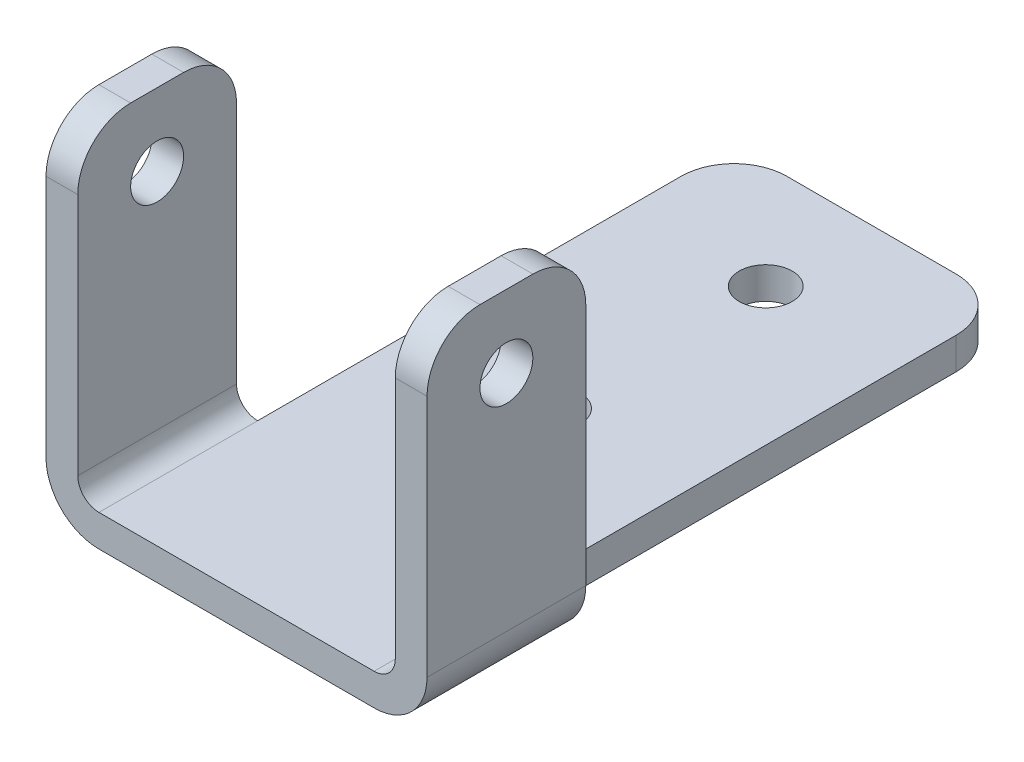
ISO-10303-21;
HEADER;
FILE_DESCRIPTION(('STEP AP214'),'2;1');
FILE_NAME('part.step','',(''),(''),'','','');
FILE_SCHEMA(('AUTOMOTIVE_DESIGN { 1 0 10303 214 1 1 1 1 }'));
ENDSEC;
DATA;
#1=APPLICATION_CONTEXT('core data for automotive mechanical design processes');
#2=APPLICATION_PROTOCOL_DEFINITION('international standard','automotive_design',2000,#1);
#3=PRODUCT_CONTEXT('',#1,'mechanical');
#4=PRODUCT('Part','Part','',(#3));
#5=PRODUCT_RELATED_PRODUCT_CATEGORY('part','',(#4));
#6=PRODUCT_DEFINITION_FORMATION('','',#4);
#7=PRODUCT_DEFINITION_CONTEXT('part definition',#1,'design');
#8=PRODUCT_DEFINITION('design','',#6,#7);
#9=PRODUCT_DEFINITION_SHAPE('','',#8);
#10=(LENGTH_UNIT() NAMED_UNIT(*) SI_UNIT(.MILLI.,.METRE.));
#11=(NAMED_UNIT(*) PLANE_ANGLE_UNIT() SI_UNIT($,.RADIAN.));
#12=(NAMED_UNIT(*) SI_UNIT($,.STERADIAN.) SOLID_ANGLE_UNIT());
#13=UNCERTAINTY_MEASURE_WITH_UNIT(LENGTH_MEASURE(1.E-05),#10,'distance_accuracy_value','');
#14=(GEOMETRIC_REPRESENTATION_CONTEXT(3) GLOBAL_UNCERTAINTY_ASSIGNED_CONTEXT((#13)) GLOBAL_UNIT_ASSIGNED_CONTEXT((#10,
#11,#12)) REPRESENTATION_CONTEXT('',''));
#15=CARTESIAN_POINT('',(0.,0.,0.));
#16=DIRECTION('',(0.,0.,1.));
#17=DIRECTION('',(1.,0.,0.));
#18=AXIS2_PLACEMENT_3D('',#15,#16,#17);
#19=CARTESIAN_POINT('',(-18.,30.,15.));
#20=DIRECTION('',(1.,0.,0.));
#21=DIRECTION('',(0.,0.,-1.));
#22=AXIS2_PLACEMENT_3D('',#19,#20,#21);
#23=PLANE('',#22);
#24=CARTESIAN_POINT('',(-18.,23.15,7.5));
#25=DIRECTION('',(1.,0.,0.));
#26=DIRECTION('',(0.,0.,-1.));
#27=AXIS2_PLACEMENT_3D('',#24,#25,#26);
#28=CIRCLE('',#27,2.5);
#29=CARTESIAN_POINT('',(-18.,23.15,5.));
#30=VERTEX_POINT('',#29);
#31=EDGE_CURVE('E265',#30,#30,#28,.T.);
#32=ORIENTED_EDGE('',*,*,#31,.T.);
#33=EDGE_LOOP('',(#32));
#34=FACE_BOUND('',#33,.T.);
#35=CARTESIAN_POINT('',(-18.,25.,10.));
#36=DIRECTION('',(-1.,0.,0.));
#37=DIRECTION('',(0.,0.,1.));
#38=AXIS2_PLACEMENT_3D('',#35,#36,#37);
#39=CIRCLE('',#38,5.);
#40=CARTESIAN_POINT('',(-18.,30.,10.));
#41=VERTEX_POINT('',#40);
#42=CARTESIAN_POINT('',(-18.,25.,15.));
#43=VERTEX_POINT('',#42);
#44=EDGE_CURVE('E20',#41,#43,#39,.F.);
#45=ORIENTED_EDGE('',*,*,#44,.F.);
#46=DIRECTION('',(0.,0.,1.));
#47=VECTOR('',#46,1.);
#48=CARTESIAN_POINT('',(-18.,30.,15.));
#49=LINE('',#48,#47);
#50=CARTESIAN_POINT('',(-18.,30.,5.));
#51=VERTEX_POINT('',#50);
#52=EDGE_CURVE('E153',#51,#41,#49,.T.);
#53=ORIENTED_EDGE('',*,*,#52,.F.);
#54=CARTESIAN_POINT('',(-18.,25.,5.));
#55=DIRECTION('',(1.,0.,0.));
#56=DIRECTION('',(0.,0.,-1.));
#57=AXIS2_PLACEMENT_3D('',#54,#55,#56);
#58=CIRCLE('',#57,5.);
#59=CARTESIAN_POINT('',(-18.,25.,0.));
#60=VERTEX_POINT('',#59);
#61=EDGE_CURVE('E172',#60,#51,#58,.T.);
#62=ORIENTED_EDGE('',*,*,#61,.F.);
#63=DIRECTION('',(0.,1.,0.));
#64=VECTOR('',#63,1.);
#65=CARTESIAN_POINT('',(-18.,-3.,0.));
#66=LINE('',#65,#64);
#67=CARTESIAN_POINT('',(-18.,2.,0.));
#68=VERTEX_POINT('',#67);
#69=EDGE_CURVE('E267',#68,#60,#66,.T.);
#70=ORIENTED_EDGE('',*,*,#69,.F.);
#71=DIRECTION('',(0.,0.,-1.));
#72=VECTOR('',#71,1.);
#73=CARTESIAN_POINT('',(-18.,2.,15.));
#74=LINE('',#73,#72);
#75=CARTESIAN_POINT('',(-18.,2.,15.));
#76=VERTEX_POINT('',#75);
#77=EDGE_CURVE('E280',#76,#68,#74,.T.);
#78=ORIENTED_EDGE('',*,*,#77,.F.);
#79=DIRECTION('',(0.,1.,0.));
#80=VECTOR('',#79,1.);
#81=CARTESIAN_POINT('',(-18.,2.,15.));
#82=LINE('',#81,#80);
#83=EDGE_CURVE('E156',#76,#43,#82,.T.);
#84=ORIENTED_EDGE('',*,*,#83,.T.);
#85=EDGE_LOOP('',(#45,#53,#62,#70,#78,#84));
#86=FACE_BOUND('',#85,.T.);
#87=ADVANCED_FACE('F17',(#34,#86),#23,.F.);
#88=CARTESIAN_POINT('',(18.,0.,15.));
#89=DIRECTION('',(-1.,0.,0.));
#90=DIRECTION('',(0.,-1.,0.));
#91=AXIS2_PLACEMENT_3D('',#88,#89,#90);
#92=PLANE('',#91);
#93=CARTESIAN_POINT('',(18.,23.15,7.5));
#94=DIRECTION('',(1.,0.,0.));
#95=DIRECTION('',(0.,0.,-1.));
#96=AXIS2_PLACEMENT_3D('',#93,#94,#95);
#97=CIRCLE('',#96,2.5);
#98=CARTESIAN_POINT('',(18.,23.15,5.));
#99=VERTEX_POINT('',#98);
#100=EDGE_CURVE('E257',#99,#99,#97,.F.);
#101=ORIENTED_EDGE('',*,*,#100,.T.);
#102=EDGE_LOOP('',(#101));
#103=FACE_BOUND('',#102,.T.);
#104=CARTESIAN_POINT('',(18.,25.,10.));
#105=DIRECTION('',(1.,0.,0.));
#106=DIRECTION('',(0.,0.,-1.));
#107=AXIS2_PLACEMENT_3D('',#104,#105,#106);
#108=CIRCLE('',#107,5.);
#109=CARTESIAN_POINT('',(18.,25.,15.));
#110=VERTEX_POINT('',#109);
#111=CARTESIAN_POINT('',(18.,30.,10.));
#112=VERTEX_POINT('',#111);
#113=EDGE_CURVE('E263',#110,#112,#108,.F.);
#114=ORIENTED_EDGE('',*,*,#113,.F.);
#115=DIRECTION('',(0.,1.,0.));
#116=VECTOR('',#115,1.);
#117=CARTESIAN_POINT('',(18.,-3.,15.));
#118=LINE('',#117,#116);
#119=CARTESIAN_POINT('',(18.,2.,15.));
#120=VERTEX_POINT('',#119);
#121=EDGE_CURVE('E260',#120,#110,#118,.T.);
#122=ORIENTED_EDGE('',*,*,#121,.F.);
#123=DIRECTION('',(0.,0.,-1.));
#124=VECTOR('',#123,1.);
#125=CARTESIAN_POINT('',(18.,2.,15.));
#126=LINE('',#125,#124);
#127=CARTESIAN_POINT('',(18.,2.,0.));
#128=VERTEX_POINT('',#127);
#129=EDGE_CURVE('E283',#128,#120,#126,.F.);
#130=ORIENTED_EDGE('',*,*,#129,.F.);
#131=DIRECTION('',(0.,1.,0.));
#132=VECTOR('',#131,1.);
#133=CARTESIAN_POINT('',(18.,2.,0.));
#134=LINE('',#133,#132);
#135=CARTESIAN_POINT('',(18.,25.,0.));
#136=VERTEX_POINT('',#135);
#137=EDGE_CURVE('E284',#136,#128,#134,.F.);
#138=ORIENTED_EDGE('',*,*,#137,.F.);
#139=CARTESIAN_POINT('',(18.,25.,5.));
#140=DIRECTION('',(1.,0.,0.));
#141=DIRECTION('',(0.,0.,-1.));
#142=AXIS2_PLACEMENT_3D('',#139,#140,#141);
#143=CIRCLE('',#142,5.);
#144=CARTESIAN_POINT('',(18.,30.,5.));
#145=VERTEX_POINT('',#144);
#146=EDGE_CURVE('E261',#145,#136,#143,.F.);
#147=ORIENTED_EDGE('',*,*,#146,.F.);
#148=DIRECTION('',(0.,0.,1.));
#149=VECTOR('',#148,1.);
#150=CARTESIAN_POINT('',(18.,30.,15.));
#151=LINE('',#150,#149);
#152=EDGE_CURVE('E178',#112,#145,#151,.F.);
#153=ORIENTED_EDGE('',*,*,#152,.F.);
#154=EDGE_LOOP('',(#114,#122,#130,#138,#147,#153));
#155=FACE_BOUND('',#154,.T.);
#156=ADVANCED_FACE('F374',(#103,#155),#92,.F.);
#157=CARTESIAN_POINT('',(-18.,30.,15.));
#158=DIRECTION('',(0.,1.,0.));
#159=DIRECTION('',(0.,0.,1.));
#160=AXIS2_PLACEMENT_3D('',#157,#158,#159);
#161=PLANE('',#160);
#162=DIRECTION('',(0.,0.,-1.));
#163=VECTOR('',#162,1.);
#164=CARTESIAN_POINT('',(-15.,30.,15.));
#165=LINE('',#164,#163);
#166=CARTESIAN_POINT('',(-15.,30.,5.));
#167=VERTEX_POINT('',#166);
#168=CARTESIAN_POINT('',(-15.,30.,10.));
#169=VERTEX_POINT('',#168);
#170=EDGE_CURVE('E256',#167,#169,#165,.F.);
#171=ORIENTED_EDGE('',*,*,#170,.F.);
#172=DIRECTION('',(1.,0.,0.));
#173=VECTOR('',#172,1.);
#174=CARTESIAN_POINT('',(-13.,30.,5.));
#175=LINE('',#174,#173);
#176=EDGE_CURVE('E165',#51,#167,#175,.T.);
#177=ORIENTED_EDGE('',*,*,#176,.F.);
#178=ORIENTED_EDGE('',*,*,#52,.T.);
#179=DIRECTION('',(-1.,0.,0.));
#180=VECTOR('',#179,1.);
#181=CARTESIAN_POINT('',(-18.,30.,10.));
#182=LINE('',#181,#180);
#183=EDGE_CURVE('E160',#169,#41,#182,.T.);
#184=ORIENTED_EDGE('',*,*,#183,.F.);
#185=EDGE_LOOP('',(#171,#177,#178,#184));
#186=FACE_BOUND('',#185,.T.);
#187=ADVANCED_FACE('F162',(#186),#161,.T.);
#188=CARTESIAN_POINT('',(-18.,25.,10.));
#189=DIRECTION('',(-1.,0.,0.));
#190=DIRECTION('',(0.,0.,1.));
#191=AXIS2_PLACEMENT_3D('',#188,#189,#190);
#192=CYLINDRICAL_SURFACE('',#191,5.);
#193=CARTESIAN_POINT('',(-15.,25.,10.));
#194=DIRECTION('',(-1.,0.,0.));
#195=DIRECTION('',(0.,0.,1.));
#196=AXIS2_PLACEMENT_3D('',#193,#194,#195);
#197=CIRCLE('',#196,5.);
#198=CARTESIAN_POINT('',(-15.,25.,15.));
#199=VERTEX_POINT('',#198);
#200=EDGE_CURVE('E170',#169,#199,#197,.F.);
#201=ORIENTED_EDGE('',*,*,#200,.F.);
#202=ORIENTED_EDGE('',*,*,#183,.T.);
#203=ORIENTED_EDGE('',*,*,#44,.T.);
#204=DIRECTION('',(-1.,0.,0.));
#205=VECTOR('',#204,1.);
#206=CARTESIAN_POINT('',(13.,25.,15.));
#207=LINE('',#206,#205);
#208=EDGE_CURVE('E176',#43,#199,#207,.F.);
#209=ORIENTED_EDGE('',*,*,#208,.T.);
#210=EDGE_LOOP('',(#201,#202,#203,#209));
#211=FACE_BOUND('',#210,.T.);
#212=ADVANCED_FACE('F168',(#211),#192,.T.);
#213=CARTESIAN_POINT('',(-13.,25.,5.));
#214=DIRECTION('',(1.,0.,0.));
#215=DIRECTION('',(0.,0.,-1.));
#216=AXIS2_PLACEMENT_3D('',#213,#214,#215);
#217=CYLINDRICAL_SURFACE('',#216,5.);
#218=CARTESIAN_POINT('',(-15.,25.,5.));
#219=DIRECTION('',(1.,0.,0.));
#220=DIRECTION('',(0.,0.,-1.));
#221=AXIS2_PLACEMENT_3D('',#218,#219,#220);
#222=CIRCLE('',#221,5.);
#223=CARTESIAN_POINT('',(-15.,25.,0.));
#224=VERTEX_POINT('',#223);
#225=EDGE_CURVE('E250',#224,#167,#222,.T.);
#226=ORIENTED_EDGE('',*,*,#225,.F.);
#227=DIRECTION('',(-1.,0.,0.));
#228=VECTOR('',#227,1.);
#229=CARTESIAN_POINT('',(-13.,25.,0.));
#230=LINE('',#229,#228);
#231=EDGE_CURVE('E271',#60,#224,#230,.F.);
#232=ORIENTED_EDGE('',*,*,#231,.F.);
#233=ORIENTED_EDGE('',*,*,#61,.T.);
#234=ORIENTED_EDGE('',*,*,#176,.T.);
#235=EDGE_LOOP('',(#226,#232,#233,#234));
#236=FACE_BOUND('',#235,.T.);
#237=ADVANCED_FACE('F492',(#236),#217,.T.);
#238=CARTESIAN_POINT('',(-79.,23.15,7.5));
#239=DIRECTION('',(1.,0.,0.));
#240=DIRECTION('',(0.,0.,-1.));
#241=AXIS2_PLACEMENT_3D('',#238,#239,#240);
#242=CYLINDRICAL_SURFACE('',#241,2.5);
#243=CARTESIAN_POINT('',(-15.,23.15,7.5));
#244=DIRECTION('',(1.,0.,0.));
#245=DIRECTION('',(0.,0.,-1.));
#246=AXIS2_PLACEMENT_3D('',#243,#244,#245);
#247=CIRCLE('',#246,2.5);
#248=CARTESIAN_POINT('',(-15.,23.15,5.));
#249=VERTEX_POINT('',#248);
#250=EDGE_CURVE('E247',#249,#249,#247,.F.);
#251=ORIENTED_EDGE('',*,*,#250,.F.);
#252=EDGE_LOOP('',(#251));
#253=FACE_BOUND('',#252,.T.);
#254=ORIENTED_EDGE('',*,*,#31,.F.);
#255=EDGE_LOOP('',(#254));
#256=FACE_BOUND('',#255,.T.);
#257=ADVANCED_FACE('F421',(#253,#256),#242,.F.);
#258=CARTESIAN_POINT('',(15.,25.,10.));
#259=DIRECTION('',(1.,0.,0.));
#260=DIRECTION('',(0.,0.,-1.));
#261=AXIS2_PLACEMENT_3D('',#258,#259,#260);
#262=CYLINDRICAL_SURFACE('',#261,5.);
#263=ORIENTED_EDGE('',*,*,#113,.T.);
#264=DIRECTION('',(1.,0.,0.));
#265=VECTOR('',#264,1.);
#266=CARTESIAN_POINT('',(15.,30.,10.));
#267=LINE('',#266,#265);
#268=CARTESIAN_POINT('',(15.,30.,10.));
#269=VERTEX_POINT('',#268);
#270=EDGE_CURVE('E180',#269,#112,#267,.T.);
#271=ORIENTED_EDGE('',*,*,#270,.F.);
#272=CARTESIAN_POINT('',(15.,25.,10.));
#273=DIRECTION('',(1.,0.,0.));
#274=DIRECTION('',(0.,0.,-1.));
#275=AXIS2_PLACEMENT_3D('',#272,#273,#274);
#276=CIRCLE('',#275,5.);
#277=CARTESIAN_POINT('',(15.,25.,15.));
#278=VERTEX_POINT('',#277);
#279=EDGE_CURVE('E237',#278,#269,#276,.F.);
#280=ORIENTED_EDGE('',*,*,#279,.F.);
#281=DIRECTION('',(1.,0.,0.));
#282=VECTOR('',#281,1.);
#283=CARTESIAN_POINT('',(13.,25.,15.));
#284=LINE('',#283,#282);
#285=EDGE_CURVE('E285',#110,#278,#284,.F.);
#286=ORIENTED_EDGE('',*,*,#285,.F.);
#287=EDGE_LOOP('',(#263,#271,#280,#286));
#288=FACE_BOUND('',#287,.T.);
#289=ADVANCED_FACE('F408',(#288),#262,.T.);
#290=CARTESIAN_POINT('',(15.,30.,15.));
#291=DIRECTION('',(0.,1.,0.));
#292=DIRECTION('',(0.,0.,1.));
#293=AXIS2_PLACEMENT_3D('',#290,#291,#292);
#294=PLANE('',#293);
#295=ORIENTED_EDGE('',*,*,#152,.T.);
#296=DIRECTION('',(1.,0.,0.));
#297=VECTOR('',#296,1.);
#298=CARTESIAN_POINT('',(13.,30.,5.));
#299=LINE('',#298,#297);
#300=CARTESIAN_POINT('',(15.,30.,5.));
#301=VERTEX_POINT('',#300);
#302=EDGE_CURVE('E179',#301,#145,#299,.T.);
#303=ORIENTED_EDGE('',*,*,#302,.F.);
#304=DIRECTION('',(0.,0.,1.));
#305=VECTOR('',#304,1.);
#306=CARTESIAN_POINT('',(15.,30.,15.));
#307=LINE('',#306,#305);
#308=EDGE_CURVE('E236',#269,#301,#307,.F.);
#309=ORIENTED_EDGE('',*,*,#308,.F.);
#310=ORIENTED_EDGE('',*,*,#270,.T.);
#311=EDGE_LOOP('',(#295,#303,#309,#310));
#312=FACE_BOUND('',#311,.T.);
#313=ADVANCED_FACE('F411',(#312),#294,.T.);
#314=CARTESIAN_POINT('',(13.,25.,5.));
#315=DIRECTION('',(1.,0.,0.));
#316=DIRECTION('',(0.,0.,-1.));
#317=AXIS2_PLACEMENT_3D('',#314,#315,#316);
#318=CYLINDRICAL_SURFACE('',#317,5.);
#319=ORIENTED_EDGE('',*,*,#146,.T.);
#320=DIRECTION('',(-1.,0.,0.));
#321=VECTOR('',#320,1.);
#322=CARTESIAN_POINT('',(13.,25.,0.));
#323=LINE('',#322,#321);
#324=CARTESIAN_POINT('',(15.,25.,0.));
#325=VERTEX_POINT('',#324);
#326=EDGE_CURVE('E287',#325,#136,#323,.F.);
#327=ORIENTED_EDGE('',*,*,#326,.F.);
#328=CARTESIAN_POINT('',(15.,25.,5.));
#329=DIRECTION('',(1.,0.,0.));
#330=DIRECTION('',(0.,0.,-1.));
#331=AXIS2_PLACEMENT_3D('',#328,#329,#330);
#332=CIRCLE('',#331,5.);
#333=EDGE_CURVE('E233',#301,#325,#332,.F.);
#334=ORIENTED_EDGE('',*,*,#333,.F.);
#335=ORIENTED_EDGE('',*,*,#302,.T.);
#336=EDGE_LOOP('',(#319,#327,#334,#335));
#337=FACE_BOUND('',#336,.T.);
#338=ADVANCED_FACE('F370',(#337),#318,.T.);
#339=CARTESIAN_POINT('',(-79.,23.15,7.5));
#340=DIRECTION('',(1.,0.,0.));
#341=DIRECTION('',(0.,0.,-1.));
#342=AXIS2_PLACEMENT_3D('',#339,#340,#341);
#343=CYLINDRICAL_SURFACE('',#342,2.5);
#344=CARTESIAN_POINT('',(15.,23.15,7.5));
#345=DIRECTION('',(1.,0.,0.));
#346=DIRECTION('',(0.,0.,-1.));
#347=AXIS2_PLACEMENT_3D('',#344,#345,#346);
#348=CIRCLE('',#347,2.5);
#349=CARTESIAN_POINT('',(15.,23.15,5.));
#350=VERTEX_POINT('',#349);
#351=EDGE_CURVE('E229',#350,#350,#348,.T.);
#352=ORIENTED_EDGE('',*,*,#351,.F.);
#353=EDGE_LOOP('',(#352));
#354=FACE_BOUND('',#353,.T.);
#355=ORIENTED_EDGE('',*,*,#100,.F.);
#356=EDGE_LOOP('',(#355));
#357=FACE_BOUND('',#356,.T.);
#358=ADVANCED_FACE('F419',(#354,#357),#343,.F.);
#359=CARTESIAN_POINT('',(-13.,2.,15.));
#360=DIRECTION('',(0.,0.,-1.));
#361=DIRECTION('',(-1.,0.,0.));
#362=AXIS2_PLACEMENT_3D('',#359,#360,#361);
#363=CYLINDRICAL_SURFACE('',#362,5.);
#364=CARTESIAN_POINT('',(-13.,2.,15.));
#365=DIRECTION('',(0.,0.,-1.));
#366=DIRECTION('',(-1.,0.,0.));
#367=AXIS2_PLACEMENT_3D('',#364,#365,#366);
#368=CIRCLE('',#367,5.);
#369=CARTESIAN_POINT('',(-13.,-3.,15.));
#370=VERTEX_POINT('',#369);
#371=EDGE_CURVE('E241',#76,#370,#368,.F.);
#372=ORIENTED_EDGE('',*,*,#371,.F.);
#373=ORIENTED_EDGE('',*,*,#77,.T.);
#374=CARTESIAN_POINT('',(-13.,2.,0.));
#375=DIRECTION('',(0.,0.,-1.));
#376=DIRECTION('',(-1.,0.,0.));
#377=AXIS2_PLACEMENT_3D('',#374,#375,#376);
#378=CIRCLE('',#377,5.);
#379=CARTESIAN_POINT('',(-13.,-3.,0.));
#380=VERTEX_POINT('',#379);
#381=EDGE_CURVE('E244',#380,#68,#378,.T.);
#382=ORIENTED_EDGE('',*,*,#381,.F.);
#383=DIRECTION('',(0.,0.,1.));
#384=VECTOR('',#383,1.);
#385=CARTESIAN_POINT('',(-13.,-3.,15.));
#386=LINE('',#385,#384);
#387=EDGE_CURVE('E225',#380,#370,#386,.T.);
#388=ORIENTED_EDGE('',*,*,#387,.T.);
#389=EDGE_LOOP('',(#372,#373,#382,#388));
#390=FACE_BOUND('',#389,.T.);
#391=ADVANCED_FACE('F471',(#390),#363,.T.);
#392=CARTESIAN_POINT('',(13.,2.,15.));
#393=DIRECTION('',(0.,0.,-1.));
#394=DIRECTION('',(-1.,0.,0.));
#395=AXIS2_PLACEMENT_3D('',#392,#393,#394);
#396=CYLINDRICAL_SURFACE('',#395,5.);
#397=CARTESIAN_POINT('',(13.,2.,15.));
#398=DIRECTION('',(0.,0.,-1.));
#399=DIRECTION('',(-1.,0.,0.));
#400=AXIS2_PLACEMENT_3D('',#397,#398,#399);
#401=CIRCLE('',#400,5.);
#402=CARTESIAN_POINT('',(13.,-3.,15.));
#403=VERTEX_POINT('',#402);
#404=EDGE_CURVE('E226',#403,#120,#401,.F.);
#405=ORIENTED_EDGE('',*,*,#404,.F.);
#406=DIRECTION('',(0.,0.,1.));
#407=VECTOR('',#406,1.);
#408=CARTESIAN_POINT('',(13.,-3.,15.));
#409=LINE('',#408,#407);
#410=CARTESIAN_POINT('',(13.,-3.,0.));
#411=VERTEX_POINT('',#410);
#412=EDGE_CURVE('E312',#403,#411,#409,.F.);
#413=ORIENTED_EDGE('',*,*,#412,.T.);
#414=CARTESIAN_POINT('',(13.,2.,0.));
#415=DIRECTION('',(0.,0.,-1.));
#416=DIRECTION('',(-1.,0.,0.));
#417=AXIS2_PLACEMENT_3D('',#414,#415,#416);
#418=CIRCLE('',#417,5.);
#419=EDGE_CURVE('E222',#128,#411,#418,.T.);
#420=ORIENTED_EDGE('',*,*,#419,.F.);
#421=ORIENTED_EDGE('',*,*,#129,.T.);
#422=EDGE_LOOP('',(#405,#413,#420,#421));
#423=FACE_BOUND('',#422,.T.);
#424=ADVANCED_FACE('F376',(#423),#396,.T.);
#425=CARTESIAN_POINT('',(-15.,30.,15.));
#426=DIRECTION('',(1.,0.,0.));
#427=DIRECTION('',(0.,0.,-1.));
#428=AXIS2_PLACEMENT_3D('',#425,#426,#427);
#429=PLANE('',#428);
#430=ORIENTED_EDGE('',*,*,#250,.T.);
#431=EDGE_LOOP('',(#430));
#432=FACE_BOUND('',#431,.T.);
#433=DIRECTION('',(0.,1.,0.));
#434=VECTOR('',#433,1.);
#435=CARTESIAN_POINT('',(-15.,30.,0.));
#436=LINE('',#435,#434);
#437=CARTESIAN_POINT('',(-15.,2.,0.));
#438=VERTEX_POINT('',#437);
#439=EDGE_CURVE('E253',#438,#224,#436,.T.);
#440=ORIENTED_EDGE('',*,*,#439,.T.);
#441=ORIENTED_EDGE('',*,*,#225,.T.);
#442=ORIENTED_EDGE('',*,*,#170,.T.);
#443=ORIENTED_EDGE('',*,*,#200,.T.);
#444=DIRECTION('',(0.,1.,0.));
#445=VECTOR('',#444,1.);
#446=CARTESIAN_POINT('',(-15.,30.,15.));
#447=LINE('',#446,#445);
#448=CARTESIAN_POINT('',(-15.,2.,15.));
#449=VERTEX_POINT('',#448);
#450=EDGE_CURVE('E255',#199,#449,#447,.F.);
#451=ORIENTED_EDGE('',*,*,#450,.T.);
#452=DIRECTION('',(0.,0.,-1.));
#453=VECTOR('',#452,1.);
#454=CARTESIAN_POINT('',(-15.,2.,15.));
#455=LINE('',#454,#453);
#456=EDGE_CURVE('E214',#449,#438,#455,.T.);
#457=ORIENTED_EDGE('',*,*,#456,.T.);
#458=EDGE_LOOP('',(#440,#441,#442,#443,#451,#457));
#459=FACE_BOUND('',#458,.T.);
#460=ADVANCED_FACE('F465',(#432,#459),#429,.T.);
#461=CARTESIAN_POINT('',(-15.,2.,0.));
#462=DIRECTION('',(0.,0.,-1.));
#463=DIRECTION('',(-1.,0.,0.));
#464=AXIS2_PLACEMENT_3D('',#461,#462,#463);
#465=PLANE('',#464);
#466=DIRECTION('',(0.,1.,0.));
#467=VECTOR('',#466,1.);
#468=CARTESIAN_POINT('',(-13.,-54.9711458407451,0.));
#469=LINE('',#468,#467);
#470=CARTESIAN_POINT('',(-13.,0.,0.));
#471=VERTEX_POINT('',#470);
#472=EDGE_CURVE('E217',#380,#471,#469,.T.);
#473=ORIENTED_EDGE('',*,*,#472,.F.);
#474=ORIENTED_EDGE('',*,*,#381,.T.);
#475=ORIENTED_EDGE('',*,*,#69,.T.);
#476=ORIENTED_EDGE('',*,*,#231,.T.);
#477=ORIENTED_EDGE('',*,*,#439,.F.);
#478=CARTESIAN_POINT('',(-13.,2.,0.));
#479=DIRECTION('',(0.,0.,-1.));
#480=DIRECTION('',(-1.,0.,0.));
#481=AXIS2_PLACEMENT_3D('',#478,#479,#480);
#482=CIRCLE('',#481,2.);
#483=EDGE_CURVE('E211',#438,#471,#482,.F.);
#484=ORIENTED_EDGE('',*,*,#483,.T.);
#485=EDGE_LOOP('',(#473,#474,#475,#476,#477,#484));
#486=FACE_BOUND('',#485,.T.);
#487=ADVANCED_FACE('F461',(#486),#465,.T.);
#488=CARTESIAN_POINT('',(15.,0.,15.));
#489=DIRECTION('',(-1.,0.,0.));
#490=DIRECTION('',(0.,-1.,0.));
#491=AXIS2_PLACEMENT_3D('',#488,#489,#490);
#492=PLANE('',#491);
#493=ORIENTED_EDGE('',*,*,#351,.T.);
#494=EDGE_LOOP('',(#493));
#495=FACE_BOUND('',#494,.T.);
#496=DIRECTION('',(0.,-1.,0.));
#497=VECTOR('',#496,1.);
#498=CARTESIAN_POINT('',(15.,0.,0.));
#499=LINE('',#498,#497);
#500=CARTESIAN_POINT('',(15.,2.,0.));
#501=VERTEX_POINT('',#500);
#502=EDGE_CURVE('E232',#325,#501,#499,.T.);
#503=ORIENTED_EDGE('',*,*,#502,.T.);
#504=DIRECTION('',(0.,0.,-1.));
#505=VECTOR('',#504,1.);
#506=CARTESIAN_POINT('',(15.,2.,15.));
#507=LINE('',#506,#505);
#508=CARTESIAN_POINT('',(15.,2.,15.));
#509=VERTEX_POINT('',#508);
#510=EDGE_CURVE('E210',#501,#509,#507,.F.);
#511=ORIENTED_EDGE('',*,*,#510,.T.);
#512=DIRECTION('',(0.,-1.,0.));
#513=VECTOR('',#512,1.);
#514=CARTESIAN_POINT('',(15.,0.,15.));
#515=LINE('',#514,#513);
#516=EDGE_CURVE('E240',#509,#278,#515,.F.);
#517=ORIENTED_EDGE('',*,*,#516,.T.);
#518=ORIENTED_EDGE('',*,*,#279,.T.);
#519=ORIENTED_EDGE('',*,*,#308,.T.);
#520=ORIENTED_EDGE('',*,*,#333,.T.);
#521=EDGE_LOOP('',(#503,#511,#517,#518,#519,#520));
#522=FACE_BOUND('',#521,.T.);
#523=ADVANCED_FACE('F366',(#495,#522),#492,.T.);
#524=CARTESIAN_POINT('',(13.,0.,0.));
#525=DIRECTION('',(0.,0.,-1.));
#526=DIRECTION('',(-1.,0.,0.));
#527=AXIS2_PLACEMENT_3D('',#524,#525,#526);
#528=PLANE('',#527);
#529=CARTESIAN_POINT('',(13.,2.,0.));
#530=DIRECTION('',(0.,0.,-1.));
#531=DIRECTION('',(-1.,0.,0.));
#532=AXIS2_PLACEMENT_3D('',#529,#530,#531);
#533=CIRCLE('',#532,2.);
#534=CARTESIAN_POINT('',(13.,0.,0.));
#535=VERTEX_POINT('',#534);
#536=EDGE_CURVE('E204',#535,#501,#533,.F.);
#537=ORIENTED_EDGE('',*,*,#536,.T.);
#538=ORIENTED_EDGE('',*,*,#502,.F.);
#539=ORIENTED_EDGE('',*,*,#326,.T.);
#540=ORIENTED_EDGE('',*,*,#137,.T.);
#541=ORIENTED_EDGE('',*,*,#419,.T.);
#542=DIRECTION('',(0.,1.,0.));
#543=VECTOR('',#542,1.);
#544=CARTESIAN_POINT('',(13.,-54.9711458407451,0.));
#545=LINE('',#544,#543);
#546=EDGE_CURVE('E203',#535,#411,#545,.F.);
#547=ORIENTED_EDGE('',*,*,#546,.F.);
#548=EDGE_LOOP('',(#537,#538,#539,#540,#541,#547));
#549=FACE_BOUND('',#548,.T.);
#550=ADVANCED_FACE('F358',(#549),#528,.T.);
#551=CARTESIAN_POINT('',(-15.,-3.,15.));
#552=DIRECTION('',(0.,1.,0.));
#553=DIRECTION('',(0.,0.,1.));
#554=AXIS2_PLACEMENT_3D('',#551,#552,#553);
#555=PLANE('',#554);
#556=CARTESIAN_POINT('',(0.,-3.,-35.));
#557=DIRECTION('',(0.,1.,0.));
#558=DIRECTION('',(0.,0.,1.));
#559=AXIS2_PLACEMENT_3D('',#556,#557,#558);
#560=CIRCLE('',#559,2.5);
#561=CARTESIAN_POINT('',(0.,-3.,-32.5));
#562=VERTEX_POINT('',#561);
#563=EDGE_CURVE('E193',#562,#562,#560,.T.);
#564=ORIENTED_EDGE('',*,*,#563,.T.);
#565=EDGE_LOOP('',(#564));
#566=FACE_BOUND('',#565,.T.);
#567=CARTESIAN_POINT('',(0.,-3.,-15.));
#568=DIRECTION('',(0.,1.,0.));
#569=DIRECTION('',(0.,0.,1.));
#570=AXIS2_PLACEMENT_3D('',#567,#568,#569);
#571=CIRCLE('',#570,2.5);
#572=CARTESIAN_POINT('',(0.,-3.,-12.5));
#573=VERTEX_POINT('',#572);
#574=EDGE_CURVE('E196',#573,#573,#571,.T.);
#575=ORIENTED_EDGE('',*,*,#574,.T.);
#576=EDGE_LOOP('',(#575));
#577=FACE_BOUND('',#576,.T.);
#578=CARTESIAN_POINT('',(-8.,-3.,-40.));
#579=DIRECTION('',(0.,1.,0.));
#580=DIRECTION('',(0.,0.,1.));
#581=AXIS2_PLACEMENT_3D('',#578,#579,#580);
#582=CIRCLE('',#581,5.);
#583=CARTESIAN_POINT('',(-8.,-3.,-45.));
#584=VERTEX_POINT('',#583);
#585=CARTESIAN_POINT('',(-13.,-3.,-40.));
#586=VERTEX_POINT('',#585);
#587=EDGE_CURVE('E218',#584,#586,#582,.T.);
#588=ORIENTED_EDGE('',*,*,#587,.F.);
#589=DIRECTION('',(-1.,0.,0.));
#590=VECTOR('',#589,1.);
#591=CARTESIAN_POINT('',(-13.,-3.,-45.));
#592=LINE('',#591,#590);
#593=CARTESIAN_POINT('',(8.,-3.,-45.));
#594=VERTEX_POINT('',#593);
#595=EDGE_CURVE('E221',#594,#584,#592,.T.);
#596=ORIENTED_EDGE('',*,*,#595,.F.);
#597=CARTESIAN_POINT('',(8.,-3.,-40.));
#598=DIRECTION('',(0.,1.,0.));
#599=DIRECTION('',(0.,0.,1.));
#600=AXIS2_PLACEMENT_3D('',#597,#598,#599);
#601=CIRCLE('',#600,5.);
#602=CARTESIAN_POINT('',(13.,-3.,-40.));
#603=VERTEX_POINT('',#602);
#604=EDGE_CURVE('E199',#603,#594,#601,.T.);
#605=ORIENTED_EDGE('',*,*,#604,.F.);
#606=DIRECTION('',(0.,0.,1.));
#607=VECTOR('',#606,1.);
#608=CARTESIAN_POINT('',(13.,-3.,0.));
#609=LINE('',#608,#607);
#610=EDGE_CURVE('E207',#411,#603,#609,.F.);
#611=ORIENTED_EDGE('',*,*,#610,.F.);
#612=ORIENTED_EDGE('',*,*,#412,.F.);
#613=DIRECTION('',(1.,0.,0.));
#614=VECTOR('',#613,1.);
#615=CARTESIAN_POINT('',(-18.,-3.,15.));
#616=LINE('',#615,#614);
#617=EDGE_CURVE('E213',#370,#403,#616,.T.);
#618=ORIENTED_EDGE('',*,*,#617,.F.);
#619=ORIENTED_EDGE('',*,*,#387,.F.);
#620=DIRECTION('',(0.,0.,1.));
#621=VECTOR('',#620,1.);
#622=CARTESIAN_POINT('',(-13.,-3.,0.));
#623=LINE('',#622,#621);
#624=EDGE_CURVE('E300',#586,#380,#623,.T.);
#625=ORIENTED_EDGE('',*,*,#624,.F.);
#626=EDGE_LOOP('',(#588,#596,#605,#611,#612,#618,#619,#625));
#627=FACE_BOUND('',#626,.T.);
#628=ADVANCED_FACE('F384',(#566,#577,#627),#555,.F.);
#629=CARTESIAN_POINT('',(-13.,-54.9711458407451,-45.));
#630=DIRECTION('',(0.,0.,-1.));
#631=DIRECTION('',(-1.,0.,0.));
#632=AXIS2_PLACEMENT_3D('',#629,#630,#631);
#633=PLANE('',#632);
#634=DIRECTION('',(1.,0.,0.));
#635=VECTOR('',#634,1.);
#636=CARTESIAN_POINT('',(-15.,0.,-45.));
#637=LINE('',#636,#635);
#638=CARTESIAN_POINT('',(8.,0.,-45.));
#639=VERTEX_POINT('',#638);
#640=CARTESIAN_POINT('',(-8.,0.,-45.));
#641=VERTEX_POINT('',#640);
#642=EDGE_CURVE('E192',#639,#641,#637,.F.);
#643=ORIENTED_EDGE('',*,*,#642,.F.);
#644=DIRECTION('',(0.,1.,0.));
#645=VECTOR('',#644,1.);
#646=CARTESIAN_POINT('',(8.,-54.9711458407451,-45.));
#647=LINE('',#646,#645);
#648=EDGE_CURVE('E202',#594,#639,#647,.T.);
#649=ORIENTED_EDGE('',*,*,#648,.F.);
#650=ORIENTED_EDGE('',*,*,#595,.T.);
#651=DIRECTION('',(0.,1.,0.));
#652=VECTOR('',#651,1.);
#653=CARTESIAN_POINT('',(-8.,-54.9711458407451,-45.));
#654=LINE('',#653,#652);
#655=EDGE_CURVE('E220',#641,#584,#654,.F.);
#656=ORIENTED_EDGE('',*,*,#655,.F.);
#657=EDGE_LOOP('',(#643,#649,#650,#656));
#658=FACE_BOUND('',#657,.T.);
#659=ADVANCED_FACE('F391',(#658),#633,.T.);
#660=CARTESIAN_POINT('',(-8.,-54.9711458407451,-40.));
#661=DIRECTION('',(0.,1.,0.));
#662=DIRECTION('',(0.,0.,1.));
#663=AXIS2_PLACEMENT_3D('',#660,#661,#662);
#664=CYLINDRICAL_SURFACE('',#663,5.);
#665=CARTESIAN_POINT('',(-8.,0.,-40.));
#666=DIRECTION('',(0.,1.,0.));
#667=DIRECTION('',(0.,0.,1.));
#668=AXIS2_PLACEMENT_3D('',#665,#666,#667);
#669=CIRCLE('',#668,5.);
#670=CARTESIAN_POINT('',(-13.,0.,-40.));
#671=VERTEX_POINT('',#670);
#672=EDGE_CURVE('E188',#641,#671,#669,.T.);
#673=ORIENTED_EDGE('',*,*,#672,.F.);
#674=ORIENTED_EDGE('',*,*,#655,.T.);
#675=ORIENTED_EDGE('',*,*,#587,.T.);
#676=DIRECTION('',(0.,1.,0.));
#677=VECTOR('',#676,1.);
#678=CARTESIAN_POINT('',(-13.,-54.9711458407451,-40.));
#679=LINE('',#678,#677);
#680=EDGE_CURVE('E303',#671,#586,#679,.F.);
#681=ORIENTED_EDGE('',*,*,#680,.F.);
#682=EDGE_LOOP('',(#673,#674,#675,#681));
#683=FACE_BOUND('',#682,.T.);
#684=ADVANCED_FACE('F395',(#683),#664,.T.);
#685=CARTESIAN_POINT('',(-13.,-54.9711458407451,0.));
#686=DIRECTION('',(-1.,0.,0.));
#687=DIRECTION('',(0.,0.,1.));
#688=AXIS2_PLACEMENT_3D('',#685,#686,#687);
#689=PLANE('',#688);
#690=ORIENTED_EDGE('',*,*,#624,.T.);
#691=ORIENTED_EDGE('',*,*,#472,.T.);
#692=DIRECTION('',(0.,0.,1.));
#693=VECTOR('',#692,1.);
#694=CARTESIAN_POINT('',(-13.,0.,15.));
#695=LINE('',#694,#693);
#696=EDGE_CURVE('E191',#671,#471,#695,.T.);
#697=ORIENTED_EDGE('',*,*,#696,.F.);
#698=ORIENTED_EDGE('',*,*,#680,.T.);
#699=EDGE_LOOP('',(#690,#691,#697,#698));
#700=FACE_BOUND('',#699,.T.);
#701=ADVANCED_FACE('F397',(#700),#689,.T.);
#702=CARTESIAN_POINT('',(-13.,2.,15.));
#703=DIRECTION('',(0.,0.,-1.));
#704=DIRECTION('',(-1.,0.,0.));
#705=AXIS2_PLACEMENT_3D('',#702,#703,#704);
#706=CYLINDRICAL_SURFACE('',#705,2.);
#707=ORIENTED_EDGE('',*,*,#456,.F.);
#708=CARTESIAN_POINT('',(-13.,2.,15.));
#709=DIRECTION('',(0.,0.,-1.));
#710=DIRECTION('',(-1.,0.,0.));
#711=AXIS2_PLACEMENT_3D('',#708,#709,#710);
#712=CIRCLE('',#711,2.);
#713=CARTESIAN_POINT('',(-13.,0.,15.));
#714=VERTEX_POINT('',#713);
#715=EDGE_CURVE('E215',#714,#449,#712,.T.);
#716=ORIENTED_EDGE('',*,*,#715,.F.);
#717=DIRECTION('',(0.,0.,1.));
#718=VECTOR('',#717,1.);
#719=CARTESIAN_POINT('',(-13.,0.,15.));
#720=LINE('',#719,#718);
#721=EDGE_CURVE('E332',#471,#714,#720,.T.);
#722=ORIENTED_EDGE('',*,*,#721,.F.);
#723=ORIENTED_EDGE('',*,*,#483,.F.);
#724=EDGE_LOOP('',(#707,#716,#722,#723));
#725=FACE_BOUND('',#724,.T.);
#726=ADVANCED_FACE('F402',(#725),#706,.F.);
#727=CARTESIAN_POINT('',(-18.,2.,15.));
#728=DIRECTION('',(0.,0.,1.));
#729=DIRECTION('',(1.,0.,0.));
#730=AXIS2_PLACEMENT_3D('',#727,#728,#729);
#731=PLANE('',#730);
#732=ORIENTED_EDGE('',*,*,#617,.T.);
#733=ORIENTED_EDGE('',*,*,#404,.T.);
#734=ORIENTED_EDGE('',*,*,#121,.T.);
#735=ORIENTED_EDGE('',*,*,#285,.T.);
#736=ORIENTED_EDGE('',*,*,#516,.F.);
#737=CARTESIAN_POINT('',(13.,2.,15.));
#738=DIRECTION('',(0.,0.,-1.));
#739=DIRECTION('',(-1.,0.,0.));
#740=AXIS2_PLACEMENT_3D('',#737,#738,#739);
#741=CIRCLE('',#740,2.);
#742=CARTESIAN_POINT('',(13.,0.,15.));
#743=VERTEX_POINT('',#742);
#744=EDGE_CURVE('E208',#509,#743,#741,.T.);
#745=ORIENTED_EDGE('',*,*,#744,.T.);
#746=DIRECTION('',(1.,0.,0.));
#747=VECTOR('',#746,1.);
#748=CARTESIAN_POINT('',(-15.,0.,15.));
#749=LINE('',#748,#747);
#750=EDGE_CURVE('E335',#714,#743,#749,.T.);
#751=ORIENTED_EDGE('',*,*,#750,.F.);
#752=ORIENTED_EDGE('',*,*,#715,.T.);
#753=ORIENTED_EDGE('',*,*,#450,.F.);
#754=ORIENTED_EDGE('',*,*,#208,.F.);
#755=ORIENTED_EDGE('',*,*,#83,.F.);
#756=ORIENTED_EDGE('',*,*,#371,.T.);
#757=EDGE_LOOP('',(#732,#733,#734,#735,#736,#745,#751,#752,#753,#754,#755,#756));
#758=FACE_BOUND('',#757,.T.);
#759=ADVANCED_FACE('F379',(#758),#731,.T.);
#760=CARTESIAN_POINT('',(13.,2.,15.));
#761=DIRECTION('',(0.,0.,-1.));
#762=DIRECTION('',(-1.,0.,0.));
#763=AXIS2_PLACEMENT_3D('',#760,#761,#762);
#764=CYLINDRICAL_SURFACE('',#763,2.);
#765=DIRECTION('',(0.,0.,1.));
#766=VECTOR('',#765,1.);
#767=CARTESIAN_POINT('',(13.,0.,15.));
#768=LINE('',#767,#766);
#769=EDGE_CURVE('E338',#743,#535,#768,.F.);
#770=ORIENTED_EDGE('',*,*,#769,.F.);
#771=ORIENTED_EDGE('',*,*,#744,.F.);
#772=ORIENTED_EDGE('',*,*,#510,.F.);
#773=ORIENTED_EDGE('',*,*,#536,.F.);
#774=EDGE_LOOP('',(#770,#771,#772,#773));
#775=FACE_BOUND('',#774,.T.);
#776=ADVANCED_FACE('F363',(#775),#764,.F.);
#777=CARTESIAN_POINT('',(13.,-54.9711458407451,0.));
#778=DIRECTION('',(1.,0.,0.));
#779=DIRECTION('',(0.,1.,0.));
#780=AXIS2_PLACEMENT_3D('',#777,#778,#779);
#781=PLANE('',#780);
#782=DIRECTION('',(0.,0.,1.));
#783=VECTOR('',#782,1.);
#784=CARTESIAN_POINT('',(13.,0.,15.));
#785=LINE('',#784,#783);
#786=CARTESIAN_POINT('',(13.,0.,-40.));
#787=VERTEX_POINT('',#786);
#788=EDGE_CURVE('E187',#535,#787,#785,.F.);
#789=ORIENTED_EDGE('',*,*,#788,.F.);
#790=ORIENTED_EDGE('',*,*,#546,.T.);
#791=ORIENTED_EDGE('',*,*,#610,.T.);
#792=DIRECTION('',(0.,1.,0.));
#793=VECTOR('',#792,1.);
#794=CARTESIAN_POINT('',(13.,-54.9711458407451,-40.));
#795=LINE('',#794,#793);
#796=EDGE_CURVE('E35',#787,#603,#795,.F.);
#797=ORIENTED_EDGE('',*,*,#796,.F.);
#798=EDGE_LOOP('',(#789,#790,#791,#797));
#799=FACE_BOUND('',#798,.T.);
#800=ADVANCED_FACE('F354',(#799),#781,.T.);
#801=CARTESIAN_POINT('',(8.,-54.9711458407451,-40.));
#802=DIRECTION('',(0.,1.,0.));
#803=DIRECTION('',(0.,0.,1.));
#804=AXIS2_PLACEMENT_3D('',#801,#802,#803);
#805=CYLINDRICAL_SURFACE('',#804,5.);
#806=CARTESIAN_POINT('',(8.,0.,-40.));
#807=DIRECTION('',(0.,1.,0.));
#808=DIRECTION('',(0.,0.,1.));
#809=AXIS2_PLACEMENT_3D('',#806,#807,#808);
#810=CIRCLE('',#809,5.);
#811=EDGE_CURVE('E184',#787,#639,#810,.T.);
#812=ORIENTED_EDGE('',*,*,#811,.F.);
#813=ORIENTED_EDGE('',*,*,#796,.T.);
#814=ORIENTED_EDGE('',*,*,#604,.T.);
#815=ORIENTED_EDGE('',*,*,#648,.T.);
#816=EDGE_LOOP('',(#812,#813,#814,#815));
#817=FACE_BOUND('',#816,.T.);
#818=ADVANCED_FACE('F389',(#817),#805,.T.);
#819=CARTESIAN_POINT('',(0.,-54.9711458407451,-15.));
#820=DIRECTION('',(0.,1.,0.));
#821=DIRECTION('',(0.,0.,1.));
#822=AXIS2_PLACEMENT_3D('',#819,#820,#821);
#823=CYLINDRICAL_SURFACE('',#822,2.5);
#824=CARTESIAN_POINT('',(0.,0.,-15.));
#825=DIRECTION('',(0.,1.,0.));
#826=DIRECTION('',(0.,0.,1.));
#827=AXIS2_PLACEMENT_3D('',#824,#825,#826);
#828=CIRCLE('',#827,2.5);
#829=CARTESIAN_POINT('',(0.,0.,-12.5));
#830=VERTEX_POINT('',#829);
#831=EDGE_CURVE('E26',#830,#830,#828,.F.);
#832=ORIENTED_EDGE('',*,*,#831,.F.);
#833=EDGE_LOOP('',(#832));
#834=FACE_BOUND('',#833,.T.);
#835=ORIENTED_EDGE('',*,*,#574,.F.);
#836=EDGE_LOOP('',(#835));
#837=FACE_BOUND('',#836,.T.);
#838=ADVANCED_FACE('F430',(#834,#837),#823,.F.);
#839=CARTESIAN_POINT('',(0.,-54.9711458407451,-35.));
#840=DIRECTION('',(0.,1.,0.));
#841=DIRECTION('',(0.,0.,1.));
#842=AXIS2_PLACEMENT_3D('',#839,#840,#841);
#843=CYLINDRICAL_SURFACE('',#842,2.5);
#844=CARTESIAN_POINT('',(0.,0.,-35.));
#845=DIRECTION('',(0.,1.,0.));
#846=DIRECTION('',(0.,0.,1.));
#847=AXIS2_PLACEMENT_3D('',#844,#845,#846);
#848=CIRCLE('',#847,2.5);
#849=CARTESIAN_POINT('',(0.,0.,-32.5));
#850=VERTEX_POINT('',#849);
#851=EDGE_CURVE('E11',#850,#850,#848,.F.);
#852=ORIENTED_EDGE('',*,*,#851,.F.);
#853=EDGE_LOOP('',(#852));
#854=FACE_BOUND('',#853,.T.);
#855=ORIENTED_EDGE('',*,*,#563,.F.);
#856=EDGE_LOOP('',(#855));
#857=FACE_BOUND('',#856,.T.);
#858=ADVANCED_FACE('F424',(#854,#857),#843,.F.);
#859=CARTESIAN_POINT('',(-15.,0.,15.));
#860=DIRECTION('',(0.,1.,0.));
#861=DIRECTION('',(0.,0.,1.));
#862=AXIS2_PLACEMENT_3D('',#859,#860,#861);
#863=PLANE('',#862);
#864=ORIENTED_EDGE('',*,*,#851,.T.);
#865=EDGE_LOOP('',(#864));
#866=FACE_BOUND('',#865,.T.);
#867=ORIENTED_EDGE('',*,*,#831,.T.);
#868=EDGE_LOOP('',(#867));
#869=FACE_BOUND('',#868,.T.);
#870=ORIENTED_EDGE('',*,*,#788,.T.);
#871=ORIENTED_EDGE('',*,*,#811,.T.);
#872=ORIENTED_EDGE('',*,*,#642,.T.);
#873=ORIENTED_EDGE('',*,*,#672,.T.);
#874=ORIENTED_EDGE('',*,*,#696,.T.);
#875=ORIENTED_EDGE('',*,*,#721,.T.);
#876=ORIENTED_EDGE('',*,*,#750,.T.);
#877=ORIENTED_EDGE('',*,*,#769,.T.);
#878=EDGE_LOOP('',(#870,#871,#872,#873,#874,#875,#876,#877));
#879=FACE_BOUND('',#878,.T.);
#880=ADVANCED_FACE('F352',(#866,#869,#879),#863,.T.);
#881=CLOSED_SHELL('',(#87,#156,#187,#212,#237,#257,#289,#313,#338,#358,#391,#424,#460,#487,#523,
#550,#628,#659,#684,#701,#726,#759,#776,#800,#818,#838,#858,#880));
#882=MANIFOLD_SOLID_BREP('B1',#881);
#883=ADVANCED_BREP_SHAPE_REPRESENTATION('',(#18,#882),#14);
#884=SHAPE_DEFINITION_REPRESENTATION(#9,#883);
ENDSEC;
END-ISO-10303-21;
